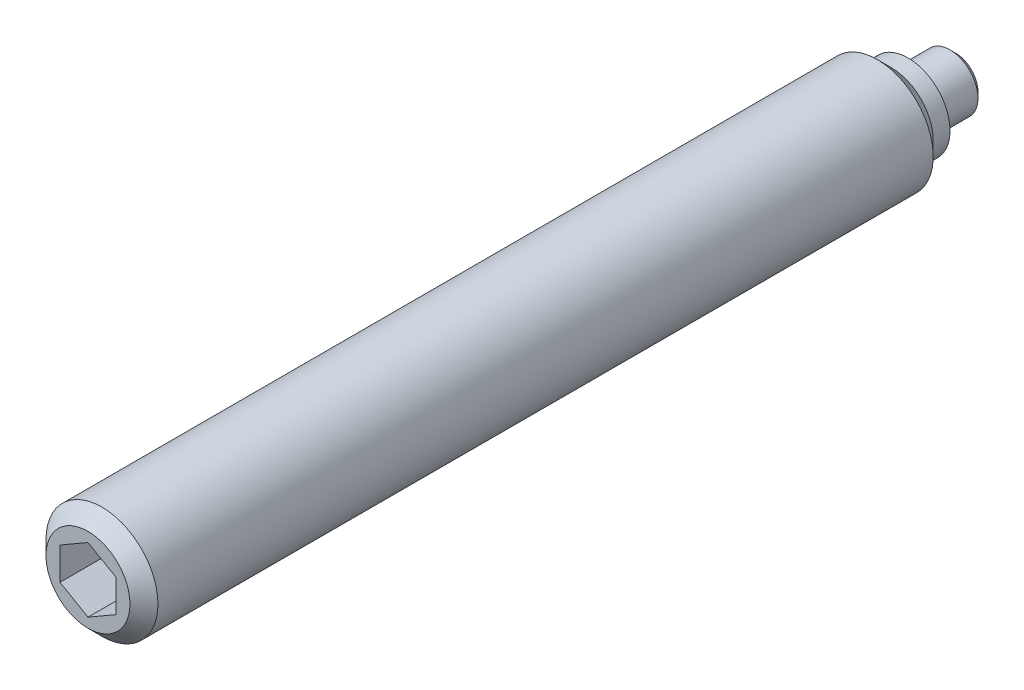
ISO-10303-21;
HEADER;
FILE_DESCRIPTION(('STEP AP214'),'2;1');
FILE_NAME('part.step','',(''),(''),'','','');
FILE_SCHEMA(('AUTOMOTIVE_DESIGN { 1 0 10303 214 1 1 1 1 }'));
ENDSEC;
DATA;
#1=APPLICATION_CONTEXT('core data for automotive mechanical design processes');
#2=APPLICATION_PROTOCOL_DEFINITION('international standard','automotive_design',2000,#1);
#3=PRODUCT_CONTEXT('',#1,'mechanical');
#4=PRODUCT('Part','Part','',(#3));
#5=PRODUCT_RELATED_PRODUCT_CATEGORY('part','',(#4));
#6=PRODUCT_DEFINITION_FORMATION('','',#4);
#7=PRODUCT_DEFINITION_CONTEXT('part definition',#1,'design');
#8=PRODUCT_DEFINITION('design','',#6,#7);
#9=PRODUCT_DEFINITION_SHAPE('','',#8);
#10=(LENGTH_UNIT() NAMED_UNIT(*) SI_UNIT(.MILLI.,.METRE.));
#11=(NAMED_UNIT(*) PLANE_ANGLE_UNIT() SI_UNIT($,.RADIAN.));
#12=(NAMED_UNIT(*) SI_UNIT($,.STERADIAN.) SOLID_ANGLE_UNIT());
#13=UNCERTAINTY_MEASURE_WITH_UNIT(LENGTH_MEASURE(1.E-05),#10,'distance_accuracy_value','');
#14=(GEOMETRIC_REPRESENTATION_CONTEXT(3) GLOBAL_UNCERTAINTY_ASSIGNED_CONTEXT((#13)) GLOBAL_UNIT_ASSIGNED_CONTEXT((#10,
#11,#12)) REPRESENTATION_CONTEXT('',''));
#15=CARTESIAN_POINT('',(0.,0.,0.));
#16=DIRECTION('',(0.,0.,1.));
#17=DIRECTION('',(1.,0.,0.));
#18=AXIS2_PLACEMENT_3D('',#15,#16,#17);
#19=CARTESIAN_POINT('',(0.,0.,0.));
#20=DIRECTION('',(0.,0.,-1.));
#21=DIRECTION('',(-1.,0.,0.));
#22=AXIS2_PLACEMENT_3D('',#19,#20,#21);
#23=CYLINDRICAL_SURFACE('',#22,1.);
#24=CARTESIAN_POINT('',(0.,0.,0.2));
#25=DIRECTION('',(0.,0.,-1.));
#26=DIRECTION('',(-1.,0.,0.));
#27=AXIS2_PLACEMENT_3D('',#24,#25,#26);
#28=CIRCLE('',#27,1.);
#29=CARTESIAN_POINT('',(-1.,0.,0.2));
#30=VERTEX_POINT('',#29);
#31=EDGE_CURVE('E133',#30,#30,#28,.T.);
#32=ORIENTED_EDGE('',*,*,#31,.F.);
#33=EDGE_LOOP('',(#32));
#34=FACE_BOUND('',#33,.T.);
#35=CARTESIAN_POINT('',(0.,0.,1.7));
#36=DIRECTION('',(0.,0.,-1.));
#37=DIRECTION('',(-1.,0.,0.));
#38=AXIS2_PLACEMENT_3D('',#35,#36,#37);
#39=CIRCLE('',#38,1.);
#40=CARTESIAN_POINT('',(-1.,0.,1.7));
#41=VERTEX_POINT('',#40);
#42=EDGE_CURVE('E127',#41,#41,#39,.T.);
#43=ORIENTED_EDGE('',*,*,#42,.T.);
#44=EDGE_LOOP('',(#43));
#45=FACE_BOUND('',#44,.T.);
#46=ADVANCED_FACE('F14',(#34,#45),#23,.T.);
#47=CARTESIAN_POINT('',(0.,0.,0.2));
#48=DIRECTION('',(0.,0.,1.));
#49=DIRECTION('',(1.,0.,0.));
#50=AXIS2_PLACEMENT_3D('',#47,#48,#49);
#51=CONICAL_SURFACE('',#50,1.,0.785398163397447);
#52=CARTESIAN_POINT('',(0.,0.,0.));
#53=DIRECTION('',(0.,0.,-1.));
#54=DIRECTION('',(-1.,0.,0.));
#55=AXIS2_PLACEMENT_3D('',#52,#53,#54);
#56=CIRCLE('',#55,0.8);
#57=CARTESIAN_POINT('',(-0.8,0.,0.));
#58=VERTEX_POINT('',#57);
#59=EDGE_CURVE('E130',#58,#58,#56,.T.);
#60=ORIENTED_EDGE('',*,*,#59,.F.);
#61=EDGE_LOOP('',(#60));
#62=FACE_BOUND('',#61,.T.);
#63=ORIENTED_EDGE('',*,*,#31,.T.);
#64=EDGE_LOOP('',(#63));
#65=FACE_BOUND('',#64,.T.);
#66=ADVANCED_FACE('F157',(#62,#65),#51,.T.);
#67=CARTESIAN_POINT('',(0.,0.8,0.));
#68=DIRECTION('',(0.,0.,1.));
#69=DIRECTION('',(1.,0.,0.));
#70=AXIS2_PLACEMENT_3D('',#67,#68,#69);
#71=PLANE('',#70);
#72=ORIENTED_EDGE('',*,*,#59,.T.);
#73=EDGE_LOOP('',(#72));
#74=FACE_BOUND('',#73,.T.);
#75=ADVANCED_FACE('F154',(#74),#71,.F.);
#76=CARTESIAN_POINT('',(0.,0.,1.7));
#77=DIRECTION('',(0.,0.,-1.));
#78=DIRECTION('',(-1.,0.,0.));
#79=AXIS2_PLACEMENT_3D('',#76,#77,#78);
#80=CYLINDRICAL_SURFACE('',#79,2.);
#81=CARTESIAN_POINT('',(0.,0.,2.8));
#82=DIRECTION('',(0.,0.,-1.));
#83=DIRECTION('',(-1.,0.,0.));
#84=AXIS2_PLACEMENT_3D('',#81,#82,#83);
#85=CIRCLE('',#84,2.);
#86=CARTESIAN_POINT('',(-2.,0.,2.8));
#87=VERTEX_POINT('',#86);
#88=EDGE_CURVE('E9',#87,#87,#85,.T.);
#89=ORIENTED_EDGE('',*,*,#88,.F.);
#90=EDGE_LOOP('',(#89));
#91=FACE_BOUND('',#90,.T.);
#92=CARTESIAN_POINT('',(0.,0.,30.5));
#93=DIRECTION('',(0.,0.,1.));
#94=DIRECTION('',(1.,0.,0.));
#95=AXIS2_PLACEMENT_3D('',#92,#93,#94);
#96=CIRCLE('',#95,2.);
#97=CARTESIAN_POINT('',(2.,0.,30.5));
#98=VERTEX_POINT('',#97);
#99=EDGE_CURVE('E124',#98,#98,#96,.T.);
#100=ORIENTED_EDGE('',*,*,#99,.F.);
#101=EDGE_LOOP('',(#100));
#102=FACE_BOUND('',#101,.T.);
#103=ADVANCED_FACE('F16',(#91,#102),#80,.T.);
#104=CARTESIAN_POINT('',(0.,0.,2.8));
#105=DIRECTION('',(0.,0.,1.));
#106=DIRECTION('',(1.,0.,0.));
#107=AXIS2_PLACEMENT_3D('',#104,#105,#106);
#108=CONICAL_SURFACE('',#107,2.,0.785398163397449);
#109=ORIENTED_EDGE('',*,*,#88,.T.);
#110=EDGE_LOOP('',(#109));
#111=FACE_BOUND('',#110,.T.);
#112=CARTESIAN_POINT('',(0.,0.,2.3));
#113=DIRECTION('',(0.,0.,-1.));
#114=DIRECTION('',(-1.,0.,0.));
#115=AXIS2_PLACEMENT_3D('',#112,#113,#114);
#116=CIRCLE('',#115,1.5);
#117=CARTESIAN_POINT('',(-1.5,0.,2.3));
#118=VERTEX_POINT('',#117);
#119=EDGE_CURVE('E22',#118,#118,#116,.T.);
#120=ORIENTED_EDGE('',*,*,#119,.F.);
#121=EDGE_LOOP('',(#120));
#122=FACE_BOUND('',#121,.T.);
#123=ADVANCED_FACE('F143',(#111,#122),#108,.T.);
#124=CARTESIAN_POINT('',(0.,0.,1.7));
#125=DIRECTION('',(0.,0.,-1.));
#126=DIRECTION('',(-1.,0.,0.));
#127=AXIS2_PLACEMENT_3D('',#124,#125,#126);
#128=CYLINDRICAL_SURFACE('',#127,1.5);
#129=CARTESIAN_POINT('',(0.,0.,1.7));
#130=DIRECTION('',(0.,0.,-1.));
#131=DIRECTION('',(-1.,0.,0.));
#132=AXIS2_PLACEMENT_3D('',#129,#130,#131);
#133=CIRCLE('',#132,1.5);
#134=CARTESIAN_POINT('',(-1.5,0.,1.7));
#135=VERTEX_POINT('',#134);
#136=EDGE_CURVE('E136',#135,#135,#133,.T.);
#137=ORIENTED_EDGE('',*,*,#136,.F.);
#138=EDGE_LOOP('',(#137));
#139=FACE_BOUND('',#138,.T.);
#140=ORIENTED_EDGE('',*,*,#119,.T.);
#141=EDGE_LOOP('',(#140));
#142=FACE_BOUND('',#141,.T.);
#143=ADVANCED_FACE('F141',(#139,#142),#128,.T.);
#144=CARTESIAN_POINT('',(0.,1.5,1.7));
#145=DIRECTION('',(0.,0.,1.));
#146=DIRECTION('',(1.,0.,0.));
#147=AXIS2_PLACEMENT_3D('',#144,#145,#146);
#148=PLANE('',#147);
#149=ORIENTED_EDGE('',*,*,#136,.T.);
#150=EDGE_LOOP('',(#149));
#151=FACE_BOUND('',#150,.T.);
#152=ORIENTED_EDGE('',*,*,#42,.F.);
#153=EDGE_LOOP('',(#152));
#154=FACE_BOUND('',#153,.T.);
#155=ADVANCED_FACE('F151',(#151,#154),#148,.F.);
#156=CARTESIAN_POINT('',(0.,-1.5,31.));
#157=DIRECTION('',(0.,0.,1.));
#158=DIRECTION('',(1.,0.,0.));
#159=AXIS2_PLACEMENT_3D('',#156,#157,#158);
#160=PLANE('',#159);
#161=DIRECTION('',(0.866025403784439,-0.5,0.));
#162=VECTOR('',#161,1.);
#163=CARTESIAN_POINT('',(-1.,-0.577350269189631,31.));
#164=LINE('',#163,#162);
#165=CARTESIAN_POINT('',(-1.,-0.577350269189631,31.));
#166=VERTEX_POINT('',#165);
#167=CARTESIAN_POINT('',(0.,-1.15470053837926,31.));
#168=VERTEX_POINT('',#167);
#169=EDGE_CURVE('E29',#166,#168,#164,.T.);
#170=ORIENTED_EDGE('',*,*,#169,.F.);
#171=DIRECTION('',(0.,-1.,0.));
#172=VECTOR('',#171,1.);
#173=CARTESIAN_POINT('',(-1.,0.577350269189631,31.));
#174=LINE('',#173,#172);
#175=CARTESIAN_POINT('',(-1.,0.577350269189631,31.));
#176=VERTEX_POINT('',#175);
#177=EDGE_CURVE('E112',#176,#166,#174,.T.);
#178=ORIENTED_EDGE('',*,*,#177,.F.);
#179=DIRECTION('',(-0.866025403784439,-0.5,0.));
#180=VECTOR('',#179,1.);
#181=CARTESIAN_POINT('',(0.,1.15470053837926,31.));
#182=LINE('',#181,#180);
#183=CARTESIAN_POINT('',(0.,1.15470053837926,31.));
#184=VERTEX_POINT('',#183);
#185=EDGE_CURVE('E110',#184,#176,#182,.T.);
#186=ORIENTED_EDGE('',*,*,#185,.F.);
#187=DIRECTION('',(-0.866025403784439,0.5,0.));
#188=VECTOR('',#187,1.);
#189=CARTESIAN_POINT('',(1.,0.577350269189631,31.));
#190=LINE('',#189,#188);
#191=CARTESIAN_POINT('',(1.,0.577350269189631,31.));
#192=VERTEX_POINT('',#191);
#193=EDGE_CURVE('E77',#192,#184,#190,.T.);
#194=ORIENTED_EDGE('',*,*,#193,.F.);
#195=DIRECTION('',(0.,1.,0.));
#196=VECTOR('',#195,1.);
#197=CARTESIAN_POINT('',(1.,-0.577350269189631,31.));
#198=LINE('',#197,#196);
#199=CARTESIAN_POINT('',(1.,-0.577350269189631,31.));
#200=VERTEX_POINT('',#199);
#201=EDGE_CURVE('E106',#200,#192,#198,.T.);
#202=ORIENTED_EDGE('',*,*,#201,.F.);
#203=DIRECTION('',(0.866025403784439,0.5,0.));
#204=VECTOR('',#203,1.);
#205=CARTESIAN_POINT('',(0.,-1.15470053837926,31.));
#206=LINE('',#205,#204);
#207=EDGE_CURVE('E103',#168,#200,#206,.T.);
#208=ORIENTED_EDGE('',*,*,#207,.F.);
#209=EDGE_LOOP('',(#170,#178,#186,#194,#202,#208));
#210=FACE_BOUND('',#209,.T.);
#211=CARTESIAN_POINT('',(0.,0.,31.));
#212=DIRECTION('',(0.,0.,1.));
#213=DIRECTION('',(1.,0.,0.));
#214=AXIS2_PLACEMENT_3D('',#211,#212,#213);
#215=CIRCLE('',#214,1.5);
#216=CARTESIAN_POINT('',(1.5,0.,31.));
#217=VERTEX_POINT('',#216);
#218=EDGE_CURVE('E116',#217,#217,#215,.T.);
#219=ORIENTED_EDGE('',*,*,#218,.T.);
#220=EDGE_LOOP('',(#219));
#221=FACE_BOUND('',#220,.T.);
#222=ADVANCED_FACE('F170',(#210,#221),#160,.T.);
#223=CARTESIAN_POINT('',(0.,0.,31.));
#224=DIRECTION('',(0.,0.,-1.));
#225=DIRECTION('',(-1.,0.,0.));
#226=AXIS2_PLACEMENT_3D('',#223,#224,#225);
#227=CONICAL_SURFACE('',#226,1.5,0.785398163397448);
#228=ORIENTED_EDGE('',*,*,#99,.T.);
#229=EDGE_LOOP('',(#228));
#230=FACE_BOUND('',#229,.T.);
#231=ORIENTED_EDGE('',*,*,#218,.F.);
#232=EDGE_LOOP('',(#231));
#233=FACE_BOUND('',#232,.T.);
#234=ADVANCED_FACE('F175',(#230,#233),#227,.T.);
#235=CARTESIAN_POINT('',(-1.,-0.577350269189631,28.5));
#236=DIRECTION('',(-0.5,-0.866025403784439,0.));
#237=DIRECTION('',(0.866025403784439,-0.5,0.));
#238=AXIS2_PLACEMENT_3D('',#235,#236,#237);
#239=PLANE('',#238);
#240=ORIENTED_EDGE('',*,*,#169,.T.);
#241=DIRECTION('',(0.,0.,1.));
#242=VECTOR('',#241,1.);
#243=CARTESIAN_POINT('',(0.,-1.15470053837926,28.5));
#244=LINE('',#243,#242);
#245=CARTESIAN_POINT('',(0.,-1.15470053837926,28.5));
#246=VERTEX_POINT('',#245);
#247=EDGE_CURVE('E59',#246,#168,#244,.T.);
#248=ORIENTED_EDGE('',*,*,#247,.F.);
#249=DIRECTION('',(0.866025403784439,-0.5,0.));
#250=VECTOR('',#249,1.);
#251=CARTESIAN_POINT('',(-1.,-0.577350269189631,28.5));
#252=LINE('',#251,#250);
#253=CARTESIAN_POINT('',(-1.,-0.577350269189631,28.5));
#254=VERTEX_POINT('',#253);
#255=EDGE_CURVE('E114',#254,#246,#252,.T.);
#256=ORIENTED_EDGE('',*,*,#255,.F.);
#257=DIRECTION('',(0.,0.,1.));
#258=VECTOR('',#257,1.);
#259=CARTESIAN_POINT('',(-1.,-0.577350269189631,28.5));
#260=LINE('',#259,#258);
#261=EDGE_CURVE('E37',#254,#166,#260,.T.);
#262=ORIENTED_EDGE('',*,*,#261,.T.);
#263=EDGE_LOOP('',(#240,#248,#256,#262));
#264=FACE_BOUND('',#263,.T.);
#265=ADVANCED_FACE('F184',(#264),#239,.F.);
#266=CARTESIAN_POINT('',(-1.,0.577350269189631,28.5));
#267=DIRECTION('',(-1.,0.,0.));
#268=DIRECTION('',(0.,0.,1.));
#269=AXIS2_PLACEMENT_3D('',#266,#267,#268);
#270=PLANE('',#269);
#271=ORIENTED_EDGE('',*,*,#177,.T.);
#272=ORIENTED_EDGE('',*,*,#261,.F.);
#273=DIRECTION('',(0.,-1.,0.));
#274=VECTOR('',#273,1.);
#275=CARTESIAN_POINT('',(-1.,0.577350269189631,28.5));
#276=LINE('',#275,#274);
#277=CARTESIAN_POINT('',(-1.,0.577350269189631,28.5));
#278=VERTEX_POINT('',#277);
#279=EDGE_CURVE('E89',#278,#254,#276,.T.);
#280=ORIENTED_EDGE('',*,*,#279,.F.);
#281=DIRECTION('',(0.,0.,1.));
#282=VECTOR('',#281,1.);
#283=CARTESIAN_POINT('',(-1.,0.577350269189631,28.5));
#284=LINE('',#283,#282);
#285=EDGE_CURVE('E81',#278,#176,#284,.T.);
#286=ORIENTED_EDGE('',*,*,#285,.T.);
#287=EDGE_LOOP('',(#271,#272,#280,#286));
#288=FACE_BOUND('',#287,.T.);
#289=ADVANCED_FACE('F244',(#288),#270,.F.);
#290=CARTESIAN_POINT('',(0.,1.15470053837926,28.5));
#291=DIRECTION('',(-0.5,0.866025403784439,0.));
#292=DIRECTION('',(-0.866025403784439,-0.5,0.));
#293=AXIS2_PLACEMENT_3D('',#290,#291,#292);
#294=PLANE('',#293);
#295=ORIENTED_EDGE('',*,*,#185,.T.);
#296=ORIENTED_EDGE('',*,*,#285,.F.);
#297=DIRECTION('',(-0.866025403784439,-0.5,0.));
#298=VECTOR('',#297,1.);
#299=CARTESIAN_POINT('',(0.,1.15470053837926,28.5));
#300=LINE('',#299,#298);
#301=CARTESIAN_POINT('',(0.,1.15470053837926,28.5));
#302=VERTEX_POINT('',#301);
#303=EDGE_CURVE('E85',#302,#278,#300,.T.);
#304=ORIENTED_EDGE('',*,*,#303,.F.);
#305=DIRECTION('',(0.,0.,1.));
#306=VECTOR('',#305,1.);
#307=CARTESIAN_POINT('',(0.,1.15470053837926,28.5));
#308=LINE('',#307,#306);
#309=EDGE_CURVE('E70',#302,#184,#308,.T.);
#310=ORIENTED_EDGE('',*,*,#309,.T.);
#311=EDGE_LOOP('',(#295,#296,#304,#310));
#312=FACE_BOUND('',#311,.T.);
#313=ADVANCED_FACE('F86',(#312),#294,.F.);
#314=CARTESIAN_POINT('',(1.,0.577350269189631,28.5));
#315=DIRECTION('',(0.5,0.866025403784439,0.));
#316=DIRECTION('',(-0.866025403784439,0.5,0.));
#317=AXIS2_PLACEMENT_3D('',#314,#315,#316);
#318=PLANE('',#317);
#319=ORIENTED_EDGE('',*,*,#193,.T.);
#320=ORIENTED_EDGE('',*,*,#309,.F.);
#321=DIRECTION('',(-0.866025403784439,0.5,0.));
#322=VECTOR('',#321,1.);
#323=CARTESIAN_POINT('',(1.,0.577350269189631,28.5));
#324=LINE('',#323,#322);
#325=CARTESIAN_POINT('',(1.,0.577350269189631,28.5));
#326=VERTEX_POINT('',#325);
#327=EDGE_CURVE('E74',#326,#302,#324,.T.);
#328=ORIENTED_EDGE('',*,*,#327,.F.);
#329=DIRECTION('',(0.,0.,1.));
#330=VECTOR('',#329,1.);
#331=CARTESIAN_POINT('',(1.,0.577350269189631,28.5));
#332=LINE('',#331,#330);
#333=EDGE_CURVE('E82',#326,#192,#332,.T.);
#334=ORIENTED_EDGE('',*,*,#333,.T.);
#335=EDGE_LOOP('',(#319,#320,#328,#334));
#336=FACE_BOUND('',#335,.T.);
#337=ADVANCED_FACE('F72',(#336),#318,.F.);
#338=CARTESIAN_POINT('',(1.,-0.577350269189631,28.5));
#339=DIRECTION('',(1.,0.,0.));
#340=DIRECTION('',(0.,0.,-1.));
#341=AXIS2_PLACEMENT_3D('',#338,#339,#340);
#342=PLANE('',#341);
#343=ORIENTED_EDGE('',*,*,#201,.T.);
#344=ORIENTED_EDGE('',*,*,#333,.F.);
#345=DIRECTION('',(0.,1.,0.));
#346=VECTOR('',#345,1.);
#347=CARTESIAN_POINT('',(1.,-0.577350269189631,28.5));
#348=LINE('',#347,#346);
#349=CARTESIAN_POINT('',(1.,-0.577350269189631,28.5));
#350=VERTEX_POINT('',#349);
#351=EDGE_CURVE('E95',#350,#326,#348,.T.);
#352=ORIENTED_EDGE('',*,*,#351,.F.);
#353=DIRECTION('',(0.,0.,1.));
#354=VECTOR('',#353,1.);
#355=CARTESIAN_POINT('',(1.,-0.577350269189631,28.5));
#356=LINE('',#355,#354);
#357=EDGE_CURVE('E119',#350,#200,#356,.T.);
#358=ORIENTED_EDGE('',*,*,#357,.T.);
#359=EDGE_LOOP('',(#343,#344,#352,#358));
#360=FACE_BOUND('',#359,.T.);
#361=ADVANCED_FACE('F268',(#360),#342,.F.);
#362=CARTESIAN_POINT('',(0.,-1.15470053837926,28.5));
#363=DIRECTION('',(0.5,-0.866025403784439,0.));
#364=DIRECTION('',(0.866025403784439,0.5,0.));
#365=AXIS2_PLACEMENT_3D('',#362,#363,#364);
#366=PLANE('',#365);
#367=ORIENTED_EDGE('',*,*,#207,.T.);
#368=ORIENTED_EDGE('',*,*,#357,.F.);
#369=DIRECTION('',(0.866025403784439,0.5,0.));
#370=VECTOR('',#369,1.);
#371=CARTESIAN_POINT('',(0.,-1.15470053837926,28.5));
#372=LINE('',#371,#370);
#373=EDGE_CURVE('E97',#246,#350,#372,.T.);
#374=ORIENTED_EDGE('',*,*,#373,.F.);
#375=ORIENTED_EDGE('',*,*,#247,.T.);
#376=EDGE_LOOP('',(#367,#368,#374,#375));
#377=FACE_BOUND('',#376,.T.);
#378=ADVANCED_FACE('F277',(#377),#366,.F.);
#379=CARTESIAN_POINT('',(0.,0.,28.5));
#380=DIRECTION('',(0.,0.,1.));
#381=DIRECTION('',(1.,0.,0.));
#382=AXIS2_PLACEMENT_3D('',#379,#380,#381);
#383=PLANE('',#382);
#384=ORIENTED_EDGE('',*,*,#255,.T.);
#385=ORIENTED_EDGE('',*,*,#373,.T.);
#386=ORIENTED_EDGE('',*,*,#351,.T.);
#387=ORIENTED_EDGE('',*,*,#327,.T.);
#388=ORIENTED_EDGE('',*,*,#303,.T.);
#389=ORIENTED_EDGE('',*,*,#279,.T.);
#390=EDGE_LOOP('',(#384,#385,#386,#387,#388,#389));
#391=FACE_BOUND('',#390,.T.);
#392=ADVANCED_FACE('F92',(#391),#383,.T.);
#393=CLOSED_SHELL('',(#46,#66,#75,#103,#123,#143,#155,#222,#234,#265,#289,#313,#337,#361,#378,#392));
#394=MANIFOLD_SOLID_BREP('B1',#393);
#395=ADVANCED_BREP_SHAPE_REPRESENTATION('',(#18,#394),#14);
#396=SHAPE_DEFINITION_REPRESENTATION(#9,#395);
ENDSEC;
END-ISO-10303-21;
